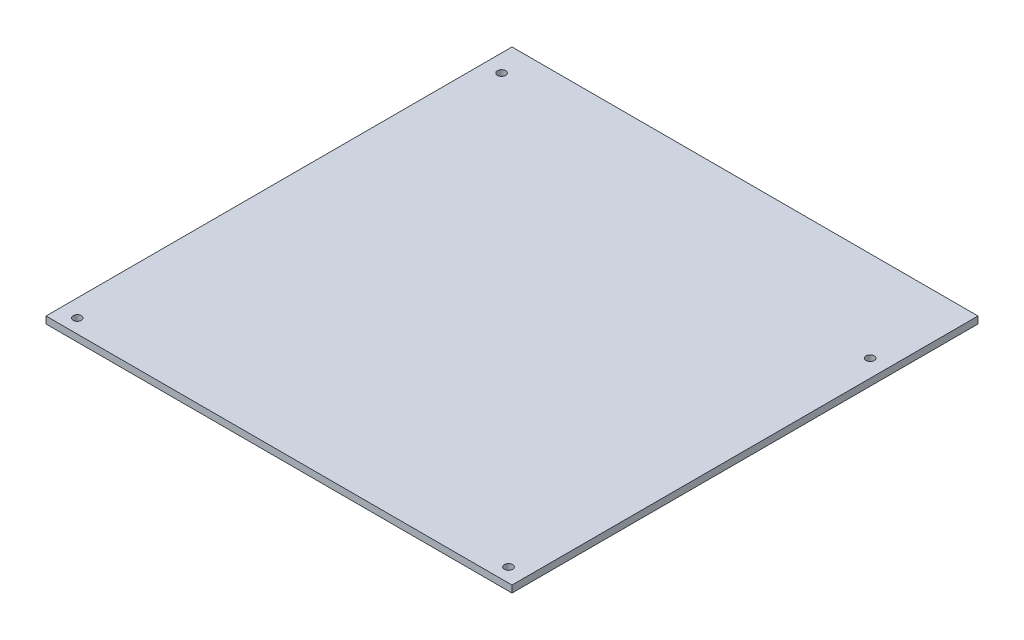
ISO-10303-21;
HEADER;
FILE_DESCRIPTION(('STEP AP214'),'2;1');
FILE_NAME('part.step','',(''),(''),'','','');
FILE_SCHEMA(('AUTOMOTIVE_DESIGN { 1 0 10303 214 1 1 1 1 }'));
ENDSEC;
DATA;
#1=APPLICATION_CONTEXT('core data for automotive mechanical design processes');
#2=APPLICATION_PROTOCOL_DEFINITION('international standard','automotive_design',2000,#1);
#3=PRODUCT_CONTEXT('',#1,'mechanical');
#4=PRODUCT('Part','Part','',(#3));
#5=PRODUCT_RELATED_PRODUCT_CATEGORY('part','',(#4));
#6=PRODUCT_DEFINITION_FORMATION('','',#4);
#7=PRODUCT_DEFINITION_CONTEXT('part definition',#1,'design');
#8=PRODUCT_DEFINITION('design','',#6,#7);
#9=PRODUCT_DEFINITION_SHAPE('','',#8);
#10=(LENGTH_UNIT() NAMED_UNIT(*) SI_UNIT(.MILLI.,.METRE.));
#11=(NAMED_UNIT(*) PLANE_ANGLE_UNIT() SI_UNIT($,.RADIAN.));
#12=(NAMED_UNIT(*) SI_UNIT($,.STERADIAN.) SOLID_ANGLE_UNIT());
#13=UNCERTAINTY_MEASURE_WITH_UNIT(LENGTH_MEASURE(1.E-05),#10,'distance_accuracy_value','');
#14=(GEOMETRIC_REPRESENTATION_CONTEXT(3) GLOBAL_UNCERTAINTY_ASSIGNED_CONTEXT((#13)) GLOBAL_UNIT_ASSIGNED_CONTEXT((#10,
#11,#12)) REPRESENTATION_CONTEXT('',''));
#15=CARTESIAN_POINT('',(0.,0.,0.));
#16=DIRECTION('',(0.,0.,1.));
#17=DIRECTION('',(1.,0.,0.));
#18=AXIS2_PLACEMENT_3D('',#15,#16,#17);
#19=CARTESIAN_POINT('',(-85.09,2.54,0.));
#20=DIRECTION('',(1.,0.,0.));
#21=DIRECTION('',(0.,0.,-1.));
#22=AXIS2_PLACEMENT_3D('',#19,#20,#21);
#23=PLANE('',#22);
#24=DIRECTION('',(0.,0.,1.));
#25=VECTOR('',#24,1.);
#26=CARTESIAN_POINT('',(-85.09,0.,0.));
#27=LINE('',#26,#25);
#28=CARTESIAN_POINT('',(-85.09,0.,-170.18));
#29=VERTEX_POINT('',#28);
#30=CARTESIAN_POINT('',(-85.09,0.,0.));
#31=VERTEX_POINT('',#30);
#32=EDGE_CURVE('E95',#29,#31,#27,.T.);
#33=ORIENTED_EDGE('',*,*,#32,.T.);
#34=DIRECTION('',(0.,-1.,0.));
#35=VECTOR('',#34,1.);
#36=CARTESIAN_POINT('',(-85.09,2.54,0.));
#37=LINE('',#36,#35);
#38=CARTESIAN_POINT('',(-85.09,2.54,0.));
#39=VERTEX_POINT('',#38);
#40=EDGE_CURVE('E11',#39,#31,#37,.T.);
#41=ORIENTED_EDGE('',*,*,#40,.F.);
#42=DIRECTION('',(0.,0.,1.));
#43=VECTOR('',#42,1.);
#44=CARTESIAN_POINT('',(-85.09,2.54,0.));
#45=LINE('',#44,#43);
#46=CARTESIAN_POINT('',(-85.09,2.54,-170.18));
#47=VERTEX_POINT('',#46);
#48=EDGE_CURVE('E83',#47,#39,#45,.T.);
#49=ORIENTED_EDGE('',*,*,#48,.F.);
#50=DIRECTION('',(0.,-1.,0.));
#51=VECTOR('',#50,1.);
#52=CARTESIAN_POINT('',(-85.09,2.54,-170.18));
#53=LINE('',#52,#51);
#54=EDGE_CURVE('E91',#47,#29,#53,.T.);
#55=ORIENTED_EDGE('',*,*,#54,.T.);
#56=EDGE_LOOP('',(#33,#41,#49,#55));
#57=FACE_BOUND('',#56,.T.);
#58=ADVANCED_FACE('F32',(#57),#23,.F.);
#59=CARTESIAN_POINT('',(-85.09,2.54,0.));
#60=DIRECTION('',(0.,0.,-1.));
#61=DIRECTION('',(-1.,0.,0.));
#62=AXIS2_PLACEMENT_3D('',#59,#60,#61);
#63=PLANE('',#62);
#64=DIRECTION('',(1.,0.,0.));
#65=VECTOR('',#64,1.);
#66=CARTESIAN_POINT('',(-85.09,0.,0.));
#67=LINE('',#66,#65);
#68=CARTESIAN_POINT('',(85.09,0.,0.));
#69=VERTEX_POINT('',#68);
#70=EDGE_CURVE('E87',#31,#69,#67,.T.);
#71=ORIENTED_EDGE('',*,*,#70,.T.);
#72=DIRECTION('',(0.,-1.,0.));
#73=VECTOR('',#72,1.);
#74=CARTESIAN_POINT('',(85.09,2.54,0.));
#75=LINE('',#74,#73);
#76=CARTESIAN_POINT('',(85.09,2.54,0.));
#77=VERTEX_POINT('',#76);
#78=EDGE_CURVE('E40',#77,#69,#75,.T.);
#79=ORIENTED_EDGE('',*,*,#78,.F.);
#80=DIRECTION('',(1.,0.,0.));
#81=VECTOR('',#80,1.);
#82=CARTESIAN_POINT('',(-85.09,2.54,0.));
#83=LINE('',#82,#81);
#84=EDGE_CURVE('E78',#39,#77,#83,.T.);
#85=ORIENTED_EDGE('',*,*,#84,.F.);
#86=ORIENTED_EDGE('',*,*,#40,.T.);
#87=EDGE_LOOP('',(#71,#79,#85,#86));
#88=FACE_BOUND('',#87,.T.);
#89=ADVANCED_FACE('F86',(#88),#63,.F.);
#90=CARTESIAN_POINT('',(85.09,2.54,0.));
#91=DIRECTION('',(-1.,0.,0.));
#92=DIRECTION('',(0.,0.,1.));
#93=AXIS2_PLACEMENT_3D('',#90,#91,#92);
#94=PLANE('',#93);
#95=DIRECTION('',(0.,0.,-1.));
#96=VECTOR('',#95,1.);
#97=CARTESIAN_POINT('',(85.09,0.,0.));
#98=LINE('',#97,#96);
#99=CARTESIAN_POINT('',(85.09,0.,-170.18));
#100=VERTEX_POINT('',#99);
#101=EDGE_CURVE('E65',#69,#100,#98,.T.);
#102=ORIENTED_EDGE('',*,*,#101,.T.);
#103=DIRECTION('',(0.,-1.,0.));
#104=VECTOR('',#103,1.);
#105=CARTESIAN_POINT('',(85.09,2.54,-170.18));
#106=LINE('',#105,#104);
#107=CARTESIAN_POINT('',(85.09,2.54,-170.18));
#108=VERTEX_POINT('',#107);
#109=EDGE_CURVE('E88',#108,#100,#106,.T.);
#110=ORIENTED_EDGE('',*,*,#109,.F.);
#111=DIRECTION('',(0.,0.,-1.));
#112=VECTOR('',#111,1.);
#113=CARTESIAN_POINT('',(85.09,2.54,0.));
#114=LINE('',#113,#112);
#115=EDGE_CURVE('E81',#77,#108,#114,.T.);
#116=ORIENTED_EDGE('',*,*,#115,.F.);
#117=ORIENTED_EDGE('',*,*,#78,.T.);
#118=EDGE_LOOP('',(#102,#110,#116,#117));
#119=FACE_BOUND('',#118,.T.);
#120=ADVANCED_FACE('F89',(#119),#94,.F.);
#121=CARTESIAN_POINT('',(-85.09,2.54,-170.18));
#122=DIRECTION('',(0.,0.,1.));
#123=DIRECTION('',(1.,0.,0.));
#124=AXIS2_PLACEMENT_3D('',#121,#122,#123);
#125=PLANE('',#124);
#126=DIRECTION('',(-1.,0.,0.));
#127=VECTOR('',#126,1.);
#128=CARTESIAN_POINT('',(-85.09,0.,-170.18));
#129=LINE('',#128,#127);
#130=EDGE_CURVE('E71',#100,#29,#129,.T.);
#131=ORIENTED_EDGE('',*,*,#130,.T.);
#132=ORIENTED_EDGE('',*,*,#54,.F.);
#133=DIRECTION('',(-1.,0.,0.));
#134=VECTOR('',#133,1.);
#135=CARTESIAN_POINT('',(-85.09,2.54,-170.18));
#136=LINE('',#135,#134);
#137=EDGE_CURVE('E48',#108,#47,#136,.T.);
#138=ORIENTED_EDGE('',*,*,#137,.F.);
#139=ORIENTED_EDGE('',*,*,#109,.T.);
#140=EDGE_LOOP('',(#131,#132,#138,#139));
#141=FACE_BOUND('',#140,.T.);
#142=ADVANCED_FACE('F103',(#141),#125,.F.);
#143=CARTESIAN_POINT('',(0.,2.54,0.));
#144=DIRECTION('',(0.,-1.,0.));
#145=DIRECTION('',(0.,0.,-1.));
#146=AXIS2_PLACEMENT_3D('',#143,#144,#145);
#147=PLANE('',#146);
#148=CARTESIAN_POINT('',(-78.74,2.54,-160.02));
#149=DIRECTION('',(0.,1.,0.));
#150=DIRECTION('',(0.,0.,1.));
#151=AXIS2_PLACEMENT_3D('',#148,#149,#150);
#152=CIRCLE('',#151,1.5);
#153=CARTESIAN_POINT('',(-78.74,2.54,-158.52));
#154=VERTEX_POINT('',#153);
#155=EDGE_CURVE('E129',#154,#154,#152,.T.);
#156=ORIENTED_EDGE('',*,*,#155,.F.);
#157=EDGE_LOOP('',(#156));
#158=FACE_BOUND('',#157,.T.);
#159=CARTESIAN_POINT('',(78.74,2.54,-137.16));
#160=DIRECTION('',(0.,1.,0.));
#161=DIRECTION('',(0.,0.,1.));
#162=AXIS2_PLACEMENT_3D('',#159,#160,#161);
#163=CIRCLE('',#162,1.5);
#164=CARTESIAN_POINT('',(78.74,2.54,-135.66));
#165=VERTEX_POINT('',#164);
#166=EDGE_CURVE('E123',#165,#165,#163,.T.);
#167=ORIENTED_EDGE('',*,*,#166,.F.);
#168=EDGE_LOOP('',(#167));
#169=FACE_BOUND('',#168,.T.);
#170=CARTESIAN_POINT('',(78.74,2.54,-5.08));
#171=DIRECTION('',(0.,1.,0.));
#172=DIRECTION('',(0.,0.,1.));
#173=AXIS2_PLACEMENT_3D('',#170,#171,#172);
#174=CIRCLE('',#173,1.5);
#175=CARTESIAN_POINT('',(78.74,2.54,-3.58));
#176=VERTEX_POINT('',#175);
#177=EDGE_CURVE('E117',#176,#176,#174,.T.);
#178=ORIENTED_EDGE('',*,*,#177,.F.);
#179=EDGE_LOOP('',(#178));
#180=FACE_BOUND('',#179,.T.);
#181=CARTESIAN_POINT('',(-78.74,2.54,-5.08));
#182=DIRECTION('',(0.,1.,0.));
#183=DIRECTION('',(0.,0.,1.));
#184=AXIS2_PLACEMENT_3D('',#181,#182,#183);
#185=CIRCLE('',#184,1.5);
#186=CARTESIAN_POINT('',(-78.74,2.54,-3.58));
#187=VERTEX_POINT('',#186);
#188=EDGE_CURVE('E111',#187,#187,#185,.T.);
#189=ORIENTED_EDGE('',*,*,#188,.F.);
#190=EDGE_LOOP('',(#189));
#191=FACE_BOUND('',#190,.T.);
#192=ORIENTED_EDGE('',*,*,#48,.T.);
#193=ORIENTED_EDGE('',*,*,#84,.T.);
#194=ORIENTED_EDGE('',*,*,#115,.T.);
#195=ORIENTED_EDGE('',*,*,#137,.T.);
#196=EDGE_LOOP('',(#192,#193,#194,#195));
#197=FACE_BOUND('',#196,.T.);
#198=ADVANCED_FACE('F79',(#158,#169,#180,#191,#197),#147,.F.);
#199=CARTESIAN_POINT('',(0.,0.,0.));
#200=DIRECTION('',(0.,-1.,0.));
#201=DIRECTION('',(0.,0.,-1.));
#202=AXIS2_PLACEMENT_3D('',#199,#200,#201);
#203=PLANE('',#202);
#204=CARTESIAN_POINT('',(-78.74,0.,-160.02));
#205=DIRECTION('',(0.,-1.,0.));
#206=DIRECTION('',(0.,0.,-1.));
#207=AXIS2_PLACEMENT_3D('',#204,#205,#206);
#208=CIRCLE('',#207,1.5);
#209=CARTESIAN_POINT('',(-78.74,0.,-161.52));
#210=VERTEX_POINT('',#209);
#211=EDGE_CURVE('E126',#210,#210,#208,.T.);
#212=ORIENTED_EDGE('',*,*,#211,.F.);
#213=EDGE_LOOP('',(#212));
#214=FACE_BOUND('',#213,.T.);
#215=CARTESIAN_POINT('',(78.74,0.,-137.16));
#216=DIRECTION('',(0.,-1.,0.));
#217=DIRECTION('',(0.,0.,-1.));
#218=AXIS2_PLACEMENT_3D('',#215,#216,#217);
#219=CIRCLE('',#218,1.5);
#220=CARTESIAN_POINT('',(78.74,0.,-138.66));
#221=VERTEX_POINT('',#220);
#222=EDGE_CURVE('E120',#221,#221,#219,.T.);
#223=ORIENTED_EDGE('',*,*,#222,.F.);
#224=EDGE_LOOP('',(#223));
#225=FACE_BOUND('',#224,.T.);
#226=CARTESIAN_POINT('',(78.74,0.,-5.08));
#227=DIRECTION('',(0.,-1.,0.));
#228=DIRECTION('',(0.,0.,-1.));
#229=AXIS2_PLACEMENT_3D('',#226,#227,#228);
#230=CIRCLE('',#229,1.5);
#231=CARTESIAN_POINT('',(78.74,0.,-6.58));
#232=VERTEX_POINT('',#231);
#233=EDGE_CURVE('E114',#232,#232,#230,.T.);
#234=ORIENTED_EDGE('',*,*,#233,.F.);
#235=EDGE_LOOP('',(#234));
#236=FACE_BOUND('',#235,.T.);
#237=CARTESIAN_POINT('',(-78.74,0.,-5.08));
#238=DIRECTION('',(0.,-1.,0.));
#239=DIRECTION('',(0.,0.,-1.));
#240=AXIS2_PLACEMENT_3D('',#237,#238,#239);
#241=CIRCLE('',#240,1.5);
#242=CARTESIAN_POINT('',(-78.74,0.,-6.58));
#243=VERTEX_POINT('',#242);
#244=EDGE_CURVE('E98',#243,#243,#241,.T.);
#245=ORIENTED_EDGE('',*,*,#244,.F.);
#246=EDGE_LOOP('',(#245));
#247=FACE_BOUND('',#246,.T.);
#248=ORIENTED_EDGE('',*,*,#32,.F.);
#249=ORIENTED_EDGE('',*,*,#130,.F.);
#250=ORIENTED_EDGE('',*,*,#101,.F.);
#251=ORIENTED_EDGE('',*,*,#70,.F.);
#252=EDGE_LOOP('',(#248,#249,#250,#251));
#253=FACE_BOUND('',#252,.T.);
#254=ADVANCED_FACE('F106',(#214,#225,#236,#247,#253),#203,.T.);
#255=CARTESIAN_POINT('',(-78.74,2.54,-5.08));
#256=DIRECTION('',(0.,1.,0.));
#257=DIRECTION('',(0.,0.,1.));
#258=AXIS2_PLACEMENT_3D('',#255,#256,#257);
#259=CYLINDRICAL_SURFACE('',#258,1.5);
#260=ORIENTED_EDGE('',*,*,#244,.T.);
#261=EDGE_LOOP('',(#260));
#262=FACE_BOUND('',#261,.T.);
#263=ORIENTED_EDGE('',*,*,#188,.T.);
#264=EDGE_LOOP('',(#263));
#265=FACE_BOUND('',#264,.T.);
#266=ADVANCED_FACE('F144',(#262,#265),#259,.F.);
#267=CARTESIAN_POINT('',(78.74,2.54,-5.08));
#268=DIRECTION('',(0.,1.,0.));
#269=DIRECTION('',(0.,0.,1.));
#270=AXIS2_PLACEMENT_3D('',#267,#268,#269);
#271=CYLINDRICAL_SURFACE('',#270,1.5);
#272=ORIENTED_EDGE('',*,*,#233,.T.);
#273=EDGE_LOOP('',(#272));
#274=FACE_BOUND('',#273,.T.);
#275=ORIENTED_EDGE('',*,*,#177,.T.);
#276=EDGE_LOOP('',(#275));
#277=FACE_BOUND('',#276,.T.);
#278=ADVANCED_FACE('F146',(#274,#277),#271,.F.);
#279=CARTESIAN_POINT('',(78.74,2.54,-137.16));
#280=DIRECTION('',(0.,1.,0.));
#281=DIRECTION('',(0.,0.,1.));
#282=AXIS2_PLACEMENT_3D('',#279,#280,#281);
#283=CYLINDRICAL_SURFACE('',#282,1.5);
#284=ORIENTED_EDGE('',*,*,#222,.T.);
#285=EDGE_LOOP('',(#284));
#286=FACE_BOUND('',#285,.T.);
#287=ORIENTED_EDGE('',*,*,#166,.T.);
#288=EDGE_LOOP('',(#287));
#289=FACE_BOUND('',#288,.T.);
#290=ADVANCED_FACE('F153',(#286,#289),#283,.F.);
#291=CARTESIAN_POINT('',(-78.74,2.54,-160.02));
#292=DIRECTION('',(0.,1.,0.));
#293=DIRECTION('',(0.,0.,1.));
#294=AXIS2_PLACEMENT_3D('',#291,#292,#293);
#295=CYLINDRICAL_SURFACE('',#294,1.5);
#296=ORIENTED_EDGE('',*,*,#211,.T.);
#297=EDGE_LOOP('',(#296));
#298=FACE_BOUND('',#297,.T.);
#299=ORIENTED_EDGE('',*,*,#155,.T.);
#300=EDGE_LOOP('',(#299));
#301=FACE_BOUND('',#300,.T.);
#302=ADVANCED_FACE('F133',(#298,#301),#295,.F.);
#303=CLOSED_SHELL('',(#58,#89,#120,#142,#198,#254,#266,#278,#290,#302));
#304=MANIFOLD_SOLID_BREP('B2',#303);
#305=ADVANCED_BREP_SHAPE_REPRESENTATION('',(#18,#304),#14);
#306=SHAPE_DEFINITION_REPRESENTATION(#9,#305);
ENDSEC;
END-ISO-10303-21;
